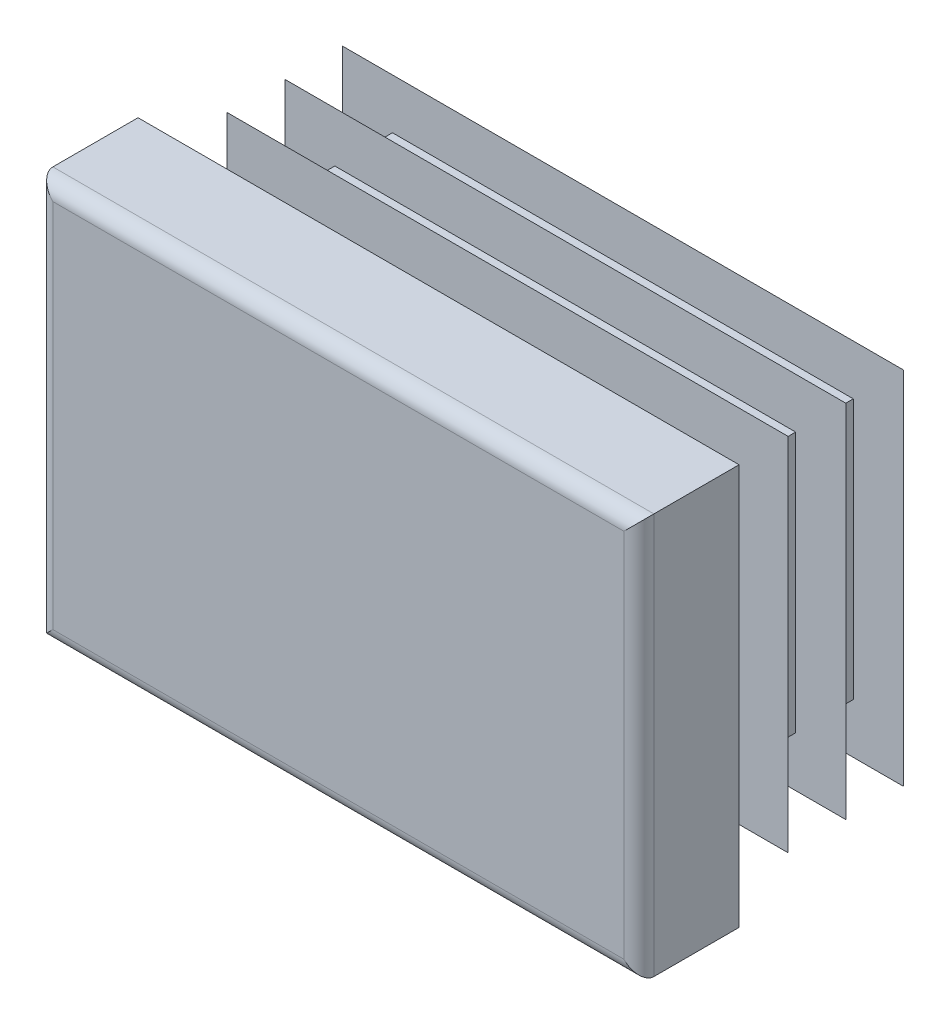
ISO-10303-21;
HEADER;
FILE_DESCRIPTION(('STEP AP214'),'2;1');
FILE_NAME('part.step','',(''),(''),'','','');
FILE_SCHEMA(('AUTOMOTIVE_DESIGN { 1 0 10303 214 1 1 1 1 }'));
ENDSEC;
DATA;
#1=APPLICATION_CONTEXT('core data for automotive mechanical design processes');
#2=APPLICATION_PROTOCOL_DEFINITION('international standard','automotive_design',2000,#1);
#3=PRODUCT_CONTEXT('',#1,'mechanical');
#4=PRODUCT('Part','Part','',(#3));
#5=PRODUCT_RELATED_PRODUCT_CATEGORY('part','',(#4));
#6=PRODUCT_DEFINITION_FORMATION('','',#4);
#7=PRODUCT_DEFINITION_CONTEXT('part definition',#1,'design');
#8=PRODUCT_DEFINITION('design','',#6,#7);
#9=PRODUCT_DEFINITION_SHAPE('','',#8);
#10=(LENGTH_UNIT() NAMED_UNIT(*) SI_UNIT(.MILLI.,.METRE.));
#11=(NAMED_UNIT(*) PLANE_ANGLE_UNIT() SI_UNIT($,.RADIAN.));
#12=(NAMED_UNIT(*) SI_UNIT($,.STERADIAN.) SOLID_ANGLE_UNIT());
#13=UNCERTAINTY_MEASURE_WITH_UNIT(LENGTH_MEASURE(1.E-05),#10,'distance_accuracy_value','');
#14=(GEOMETRIC_REPRESENTATION_CONTEXT(3) GLOBAL_UNCERTAINTY_ASSIGNED_CONTEXT((#13)) GLOBAL_UNIT_ASSIGNED_CONTEXT((#10,
#11,#12)) REPRESENTATION_CONTEXT('',''));
#15=CARTESIAN_POINT('',(0.,0.,0.));
#16=DIRECTION('',(0.,0.,1.));
#17=DIRECTION('',(1.,0.,0.));
#18=AXIS2_PLACEMENT_3D('',#15,#16,#17);
#19=CARTESIAN_POINT('',(14.25,-10.,5.));
#20=DIRECTION('',(0.,0.,-1.));
#21=DIRECTION('',(0.,1.,0.));
#22=AXIS2_PLACEMENT_3D('',#19,#20,#21);
#23=PLANE('',#22);
#24=DIRECTION('',(0.,1.,0.));
#25=VECTOR('',#24,1.);
#26=CARTESIAN_POINT('',(-14.25,-10.,5.));
#27=LINE('',#26,#25);
#28=CARTESIAN_POINT('',(-14.25,-9.25,5.));
#29=VERTEX_POINT('',#28);
#30=CARTESIAN_POINT('',(-14.25,9.25,5.));
#31=VERTEX_POINT('',#30);
#32=EDGE_CURVE('E310',#29,#31,#27,.T.);
#33=ORIENTED_EDGE('',*,*,#32,.F.);
#34=DIRECTION('',(-1.,0.,0.));
#35=VECTOR('',#34,1.);
#36=CARTESIAN_POINT('',(15.,-9.25,5.));
#37=LINE('',#36,#35);
#38=CARTESIAN_POINT('',(14.25,-9.25,5.));
#39=VERTEX_POINT('',#38);
#40=EDGE_CURVE('E482',#39,#29,#37,.T.);
#41=ORIENTED_EDGE('',*,*,#40,.F.);
#42=DIRECTION('',(0.,1.,0.));
#43=VECTOR('',#42,1.);
#44=CARTESIAN_POINT('',(14.25,-10.,5.));
#45=LINE('',#44,#43);
#46=CARTESIAN_POINT('',(14.25,9.25,5.));
#47=VERTEX_POINT('',#46);
#48=EDGE_CURVE('E305',#39,#47,#45,.T.);
#49=ORIENTED_EDGE('',*,*,#48,.T.);
#50=DIRECTION('',(-1.,0.,0.));
#51=VECTOR('',#50,1.);
#52=CARTESIAN_POINT('',(15.,9.25,5.));
#53=LINE('',#52,#51);
#54=EDGE_CURVE('E630',#47,#31,#53,.T.);
#55=ORIENTED_EDGE('',*,*,#54,.T.);
#56=EDGE_LOOP('',(#33,#41,#49,#55));
#57=FACE_BOUND('',#56,.T.);
#58=ADVANCED_FACE('F14',(#57),#23,.F.);
#59=CARTESIAN_POINT('',(-14.25,-10.,4.25));
#60=DIRECTION('',(0.,1.,0.));
#61=DIRECTION('',(-1.,0.,0.));
#62=AXIS2_PLACEMENT_3D('',#59,#60,#61);
#63=CYLINDRICAL_SURFACE('',#62,0.75);
#64=DIRECTION('',(0.,1.,0.));
#65=VECTOR('',#64,1.);
#66=CARTESIAN_POINT('',(-15.,-10.,4.25));
#67=LINE('',#66,#65);
#68=CARTESIAN_POINT('',(-15.,-10.,4.25));
#69=VERTEX_POINT('',#68);
#70=CARTESIAN_POINT('',(-15.,10.,4.25));
#71=VERTEX_POINT('',#70);
#72=EDGE_CURVE('E402',#69,#71,#67,.T.);
#73=ORIENTED_EDGE('',*,*,#72,.F.);
#74=CARTESIAN_POINT('',(-14.25,-9.25,4.25));
#75=DIRECTION('',(-0.707106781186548,0.707106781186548,0.));
#76=DIRECTION('',(0.707106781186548,0.707106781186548,0.));
#77=AXIS2_PLACEMENT_3D('',#74,#75,#76);
#78=ELLIPSE('',#77,1.06066017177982,0.75);
#79=EDGE_CURVE('E59',#69,#29,#78,.T.);
#80=ORIENTED_EDGE('',*,*,#79,.T.);
#81=ORIENTED_EDGE('',*,*,#32,.T.);
#82=CARTESIAN_POINT('',(-14.25,9.25,4.25));
#83=DIRECTION('',(0.707106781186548,0.707106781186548,0.));
#84=DIRECTION('',(-0.707106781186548,0.707106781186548,0.));
#85=AXIS2_PLACEMENT_3D('',#82,#83,#84);
#86=ELLIPSE('',#85,1.06066017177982,0.75);
#87=EDGE_CURVE('E306',#31,#71,#86,.F.);
#88=ORIENTED_EDGE('',*,*,#87,.T.);
#89=EDGE_LOOP('',(#73,#80,#81,#88));
#90=FACE_BOUND('',#89,.T.);
#91=ADVANCED_FACE('F16',(#90),#63,.T.);
#92=CARTESIAN_POINT('',(-15.,-10.,4.25));
#93=DIRECTION('',(1.,0.,0.));
#94=DIRECTION('',(0.,1.,0.));
#95=AXIS2_PLACEMENT_3D('',#92,#93,#94);
#96=PLANE('',#95);
#97=DIRECTION('',(0.,0.,-1.));
#98=VECTOR('',#97,1.);
#99=CARTESIAN_POINT('',(-15.,10.,4.25));
#100=LINE('',#99,#98);
#101=CARTESIAN_POINT('',(-15.,10.,0.));
#102=VERTEX_POINT('',#101);
#103=EDGE_CURVE('E615',#71,#102,#100,.T.);
#104=ORIENTED_EDGE('',*,*,#103,.T.);
#105=DIRECTION('',(0.,1.,0.));
#106=VECTOR('',#105,1.);
#107=CARTESIAN_POINT('',(-15.,-10.,0.));
#108=LINE('',#107,#106);
#109=CARTESIAN_POINT('',(-15.,-10.,0.));
#110=VERTEX_POINT('',#109);
#111=EDGE_CURVE('E400',#110,#102,#108,.T.);
#112=ORIENTED_EDGE('',*,*,#111,.F.);
#113=DIRECTION('',(0.,0.,-1.));
#114=VECTOR('',#113,1.);
#115=CARTESIAN_POINT('',(-15.,-10.,4.25));
#116=LINE('',#115,#114);
#117=EDGE_CURVE('E616',#69,#110,#116,.T.);
#118=ORIENTED_EDGE('',*,*,#117,.F.);
#119=ORIENTED_EDGE('',*,*,#72,.T.);
#120=EDGE_LOOP('',(#104,#112,#118,#119));
#121=FACE_BOUND('',#120,.T.);
#122=ADVANCED_FACE('F697',(#121),#96,.F.);
#123=CARTESIAN_POINT('',(-11.5,-10.,0.));
#124=DIRECTION('',(1.,0.,0.));
#125=DIRECTION('',(0.,1.,0.));
#126=AXIS2_PLACEMENT_3D('',#123,#124,#125);
#127=PLANE('',#126);
#128=DIRECTION('',(0.,1.,0.));
#129=VECTOR('',#128,1.);
#130=CARTESIAN_POINT('',(-11.5,-10.,0.));
#131=LINE('',#130,#129);
#132=CARTESIAN_POINT('',(-11.5,-6.5,0.));
#133=VERTEX_POINT('',#132);
#134=CARTESIAN_POINT('',(-11.5,6.5,0.));
#135=VERTEX_POINT('',#134);
#136=EDGE_CURVE('E397',#133,#135,#131,.T.);
#137=ORIENTED_EDGE('',*,*,#136,.T.);
#138=DIRECTION('',(0.,0.,-1.));
#139=VECTOR('',#138,1.);
#140=CARTESIAN_POINT('',(-11.5,6.5,0.));
#141=LINE('',#140,#139);
#142=CARTESIAN_POINT('',(-11.5,6.5,-0.575));
#143=VERTEX_POINT('',#142);
#144=EDGE_CURVE('E495',#135,#143,#141,.T.);
#145=ORIENTED_EDGE('',*,*,#144,.T.);
#146=DIRECTION('',(0.,1.,0.));
#147=VECTOR('',#146,1.);
#148=CARTESIAN_POINT('',(-11.5,-10.,-0.575));
#149=LINE('',#148,#147);
#150=CARTESIAN_POINT('',(-11.5,-6.5,-0.575));
#151=VERTEX_POINT('',#150);
#152=EDGE_CURVE('E394',#151,#143,#149,.T.);
#153=ORIENTED_EDGE('',*,*,#152,.F.);
#154=DIRECTION('',(0.,0.,1.));
#155=VECTOR('',#154,1.);
#156=CARTESIAN_POINT('',(-11.5,-6.5,0.));
#157=LINE('',#156,#155);
#158=EDGE_CURVE('E489',#151,#133,#157,.T.);
#159=ORIENTED_EDGE('',*,*,#158,.T.);
#160=EDGE_LOOP('',(#137,#145,#153,#159));
#161=FACE_BOUND('',#160,.T.);
#162=ADVANCED_FACE('F787',(#161),#127,.F.);
#163=CARTESIAN_POINT('',(-14.,-10.,-0.575));
#164=DIRECTION('',(0.342020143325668,0.,0.939692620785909));
#165=DIRECTION('',(-0.939692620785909,0.,0.342020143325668));
#166=AXIS2_PLACEMENT_3D('',#163,#164,#165);
#167=PLANE('',#166);
#168=DIRECTION('',(0.,1.,0.));
#169=VECTOR('',#168,1.);
#170=CARTESIAN_POINT('',(-14.,-10.,-0.575));
#171=LINE('',#170,#169);
#172=CARTESIAN_POINT('',(-14.,-9.,-0.575));
#173=VERTEX_POINT('',#172);
#174=CARTESIAN_POINT('',(-14.,9.,-0.575));
#175=VERTEX_POINT('',#174);
#176=EDGE_CURVE('E392',#173,#175,#171,.T.);
#177=ORIENTED_EDGE('',*,*,#176,.T.);
#178=DIRECTION('',(0.844349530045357,-0.438895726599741,-0.307318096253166));
#179=VECTOR('',#178,1.);
#180=CARTESIAN_POINT('',(-6.95895339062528,5.34004028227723,-3.13773138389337));
#181=LINE('',#180,#179);
#182=CARTESIAN_POINT('',(-11.5,7.70049158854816,-1.48492558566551));
#183=VERTEX_POINT('',#182);
#184=EDGE_CURVE('E519',#175,#183,#181,.T.);
#185=ORIENTED_EDGE('',*,*,#184,.T.);
#186=DIRECTION('',(0.,1.,0.));
#187=VECTOR('',#186,1.);
#188=CARTESIAN_POINT('',(-11.5,-10.,-1.48492558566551));
#189=LINE('',#188,#187);
#190=CARTESIAN_POINT('',(-11.5,-7.70049158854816,-1.48492558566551));
#191=VERTEX_POINT('',#190);
#192=EDGE_CURVE('E389',#191,#183,#189,.T.);
#193=ORIENTED_EDGE('',*,*,#192,.F.);
#194=DIRECTION('',(-0.844349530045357,-0.438895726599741,0.307318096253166));
#195=VECTOR('',#194,1.);
#196=CARTESIAN_POINT('',(-14.3705814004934,-9.19262945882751,-0.440119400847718));
#197=LINE('',#196,#195);
#198=EDGE_CURVE('E507',#191,#173,#197,.T.);
#199=ORIENTED_EDGE('',*,*,#198,.T.);
#200=EDGE_LOOP('',(#177,#185,#193,#199));
#201=FACE_BOUND('',#200,.T.);
#202=ADVANCED_FACE('F783',(#201),#167,.F.);
#203=CARTESIAN_POINT('',(-11.5,-10.,-1.48492558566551));
#204=DIRECTION('',(1.,0.,0.));
#205=DIRECTION('',(0.,1.,0.));
#206=AXIS2_PLACEMENT_3D('',#203,#204,#205);
#207=PLANE('',#206);
#208=ORIENTED_EDGE('',*,*,#192,.T.);
#209=DIRECTION('',(0.,-0.819152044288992,-0.573576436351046));
#210=VECTOR('',#209,1.);
#211=CARTESIAN_POINT('',(-11.5,-4.17671654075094,-9.80143625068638));
#212=LINE('',#211,#210);
#213=CARTESIAN_POINT('',(-11.5,6.5,-2.32551884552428));
#214=VERTEX_POINT('',#213);
#215=EDGE_CURVE('E516',#183,#214,#212,.T.);
#216=ORIENTED_EDGE('',*,*,#215,.T.);
#217=DIRECTION('',(0.,0.,-1.));
#218=VECTOR('',#217,1.);
#219=CARTESIAN_POINT('',(-11.5,6.5,-1.48492558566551));
#220=LINE('',#219,#218);
#221=CARTESIAN_POINT('',(-11.5,6.5,-3.45));
#222=VERTEX_POINT('',#221);
#223=EDGE_CURVE('E525',#214,#222,#220,.T.);
#224=ORIENTED_EDGE('',*,*,#223,.T.);
#225=DIRECTION('',(0.,1.,0.));
#226=VECTOR('',#225,1.);
#227=CARTESIAN_POINT('',(-11.5,-10.,-3.45));
#228=LINE('',#227,#226);
#229=CARTESIAN_POINT('',(-11.5,-6.5,-3.45));
#230=VERTEX_POINT('',#229);
#231=EDGE_CURVE('E386',#230,#222,#228,.T.);
#232=ORIENTED_EDGE('',*,*,#231,.F.);
#233=DIRECTION('',(0.,0.,1.));
#234=VECTOR('',#233,1.);
#235=CARTESIAN_POINT('',(-11.5,-6.5,-1.48492558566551));
#236=LINE('',#235,#234);
#237=CARTESIAN_POINT('',(-11.5,-6.5,-2.32551884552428));
#238=VERTEX_POINT('',#237);
#239=EDGE_CURVE('E522',#230,#238,#236,.T.);
#240=ORIENTED_EDGE('',*,*,#239,.T.);
#241=DIRECTION('',(0.,-0.819152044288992,0.573576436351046));
#242=VECTOR('',#241,1.);
#243=CARTESIAN_POINT('',(-11.5,-9.24348489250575,-0.404510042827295));
#244=LINE('',#243,#242);
#245=EDGE_CURVE('E504',#238,#191,#244,.T.);
#246=ORIENTED_EDGE('',*,*,#245,.T.);
#247=EDGE_LOOP('',(#208,#216,#224,#232,#240,#246));
#248=FACE_BOUND('',#247,.T.);
#249=ADVANCED_FACE('F779',(#248),#207,.F.);
#250=CARTESIAN_POINT('',(-14.,-10.,-3.45));
#251=DIRECTION('',(0.342020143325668,0.,0.939692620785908));
#252=DIRECTION('',(-0.939692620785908,0.,0.342020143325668));
#253=AXIS2_PLACEMENT_3D('',#250,#251,#252);
#254=PLANE('',#253);
#255=DIRECTION('',(0.,1.,0.));
#256=VECTOR('',#255,1.);
#257=CARTESIAN_POINT('',(-14.,-10.,-3.45));
#258=LINE('',#257,#256);
#259=CARTESIAN_POINT('',(-14.,-9.,-3.45));
#260=VERTEX_POINT('',#259);
#261=CARTESIAN_POINT('',(-14.,9.,-3.45));
#262=VERTEX_POINT('',#261);
#263=EDGE_CURVE('E384',#260,#262,#258,.T.);
#264=ORIENTED_EDGE('',*,*,#263,.T.);
#265=DIRECTION('',(0.844349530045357,-0.43889572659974,-0.307318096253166));
#266=VECTOR('',#265,1.);
#267=CARTESIAN_POINT('',(-6.95895339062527,5.34004028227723,-6.01273138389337));
#268=LINE('',#267,#266);
#269=CARTESIAN_POINT('',(-11.5,7.70049158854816,-4.35992558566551));
#270=VERTEX_POINT('',#269);
#271=EDGE_CURVE('E549',#262,#270,#268,.T.);
#272=ORIENTED_EDGE('',*,*,#271,.T.);
#273=DIRECTION('',(0.,1.,0.));
#274=VECTOR('',#273,1.);
#275=CARTESIAN_POINT('',(-11.5,-10.,-4.35992558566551));
#276=LINE('',#275,#274);
#277=CARTESIAN_POINT('',(-11.5,-7.70049158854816,-4.35992558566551));
#278=VERTEX_POINT('',#277);
#279=EDGE_CURVE('E381',#278,#270,#276,.T.);
#280=ORIENTED_EDGE('',*,*,#279,.F.);
#281=DIRECTION('',(-0.844349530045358,-0.438895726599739,0.307318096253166));
#282=VECTOR('',#281,1.);
#283=CARTESIAN_POINT('',(-14.3705814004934,-9.19262945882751,-3.31511940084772));
#284=LINE('',#283,#282);
#285=EDGE_CURVE('E537',#278,#260,#284,.T.);
#286=ORIENTED_EDGE('',*,*,#285,.T.);
#287=EDGE_LOOP('',(#264,#272,#280,#286));
#288=FACE_BOUND('',#287,.T.);
#289=ADVANCED_FACE('F775',(#288),#254,.F.);
#290=CARTESIAN_POINT('',(-11.5,-10.,-4.35992558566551));
#291=DIRECTION('',(1.,0.,0.));
#292=DIRECTION('',(0.,1.,0.));
#293=AXIS2_PLACEMENT_3D('',#290,#291,#292);
#294=PLANE('',#293);
#295=ORIENTED_EDGE('',*,*,#279,.T.);
#296=DIRECTION('',(0.,-0.819152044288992,-0.573576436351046));
#297=VECTOR('',#296,1.);
#298=CARTESIAN_POINT('',(-11.5,-4.17671654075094,-12.6764362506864));
#299=LINE('',#298,#297);
#300=CARTESIAN_POINT('',(-11.5,6.5,-5.20051884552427));
#301=VERTEX_POINT('',#300);
#302=EDGE_CURVE('E546',#270,#301,#299,.T.);
#303=ORIENTED_EDGE('',*,*,#302,.T.);
#304=DIRECTION('',(0.,0.,-1.));
#305=VECTOR('',#304,1.);
#306=CARTESIAN_POINT('',(-11.5,6.5,-4.35992558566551));
#307=LINE('',#306,#305);
#308=CARTESIAN_POINT('',(-11.5,6.5,-6.325));
#309=VERTEX_POINT('',#308);
#310=EDGE_CURVE('E555',#301,#309,#307,.T.);
#311=ORIENTED_EDGE('',*,*,#310,.T.);
#312=DIRECTION('',(0.,1.,0.));
#313=VECTOR('',#312,1.);
#314=CARTESIAN_POINT('',(-11.5,-10.,-6.325));
#315=LINE('',#314,#313);
#316=CARTESIAN_POINT('',(-11.5,-6.5,-6.325));
#317=VERTEX_POINT('',#316);
#318=EDGE_CURVE('E378',#317,#309,#315,.T.);
#319=ORIENTED_EDGE('',*,*,#318,.F.);
#320=DIRECTION('',(0.,0.,1.));
#321=VECTOR('',#320,1.);
#322=CARTESIAN_POINT('',(-11.5,-6.5,-4.35992558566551));
#323=LINE('',#322,#321);
#324=CARTESIAN_POINT('',(-11.5,-6.5,-5.20051884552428));
#325=VERTEX_POINT('',#324);
#326=EDGE_CURVE('E552',#317,#325,#323,.T.);
#327=ORIENTED_EDGE('',*,*,#326,.T.);
#328=DIRECTION('',(0.,-0.819152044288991,0.573576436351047));
#329=VECTOR('',#328,1.);
#330=CARTESIAN_POINT('',(-11.5,-9.24348489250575,-3.27951004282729));
#331=LINE('',#330,#329);
#332=EDGE_CURVE('E534',#325,#278,#331,.T.);
#333=ORIENTED_EDGE('',*,*,#332,.T.);
#334=EDGE_LOOP('',(#295,#303,#311,#319,#327,#333));
#335=FACE_BOUND('',#334,.T.);
#336=ADVANCED_FACE('F771',(#335),#294,.F.);
#337=CARTESIAN_POINT('',(-14.,-10.,-6.325));
#338=DIRECTION('',(0.34202014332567,0.,0.939692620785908));
#339=DIRECTION('',(-0.939692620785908,0.,0.34202014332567));
#340=AXIS2_PLACEMENT_3D('',#337,#338,#339);
#341=PLANE('',#340);
#342=DIRECTION('',(0.,1.,0.));
#343=VECTOR('',#342,1.);
#344=CARTESIAN_POINT('',(-14.,-10.,-6.325));
#345=LINE('',#344,#343);
#346=CARTESIAN_POINT('',(-14.,-9.,-6.325));
#347=VERTEX_POINT('',#346);
#348=CARTESIAN_POINT('',(-14.,9.,-6.325));
#349=VERTEX_POINT('',#348);
#350=EDGE_CURVE('E376',#347,#349,#345,.T.);
#351=ORIENTED_EDGE('',*,*,#350,.T.);
#352=DIRECTION('',(0.844349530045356,-0.438895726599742,-0.307318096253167));
#353=VECTOR('',#352,1.);
#354=CARTESIAN_POINT('',(-6.95895339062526,5.34004028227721,-8.88773138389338));
#355=LINE('',#354,#353);
#356=CARTESIAN_POINT('',(-11.5,7.70049158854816,-7.23492558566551));
#357=VERTEX_POINT('',#356);
#358=EDGE_CURVE('E579',#349,#357,#355,.T.);
#359=ORIENTED_EDGE('',*,*,#358,.T.);
#360=DIRECTION('',(0.,1.,0.));
#361=VECTOR('',#360,1.);
#362=CARTESIAN_POINT('',(-11.5,-10.,-7.23492558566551));
#363=LINE('',#362,#361);
#364=CARTESIAN_POINT('',(-11.5,-7.70049158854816,-7.23492558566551));
#365=VERTEX_POINT('',#364);
#366=EDGE_CURVE('E373',#365,#357,#363,.T.);
#367=ORIENTED_EDGE('',*,*,#366,.F.);
#368=DIRECTION('',(-0.844349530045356,-0.438895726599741,0.307318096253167));
#369=VECTOR('',#368,1.);
#370=CARTESIAN_POINT('',(-14.3705814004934,-9.19262945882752,-6.19011940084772));
#371=LINE('',#370,#369);
#372=EDGE_CURVE('E567',#365,#347,#371,.T.);
#373=ORIENTED_EDGE('',*,*,#372,.T.);
#374=EDGE_LOOP('',(#351,#359,#367,#373));
#375=FACE_BOUND('',#374,.T.);
#376=ADVANCED_FACE('F767',(#375),#341,.F.);
#377=CARTESIAN_POINT('',(-11.5,-10.,-7.23492558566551));
#378=DIRECTION('',(1.,0.,0.));
#379=DIRECTION('',(0.,1.,0.));
#380=AXIS2_PLACEMENT_3D('',#377,#378,#379);
#381=PLANE('',#380);
#382=ORIENTED_EDGE('',*,*,#366,.T.);
#383=DIRECTION('',(0.,-0.819152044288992,-0.573576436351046));
#384=VECTOR('',#383,1.);
#385=CARTESIAN_POINT('',(-11.5,-4.17671654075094,-15.5514362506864));
#386=LINE('',#385,#384);
#387=CARTESIAN_POINT('',(-11.5,6.5,-8.07551884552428));
#388=VERTEX_POINT('',#387);
#389=EDGE_CURVE('E576',#357,#388,#386,.T.);
#390=ORIENTED_EDGE('',*,*,#389,.T.);
#391=DIRECTION('',(0.,0.,-1.));
#392=VECTOR('',#391,1.);
#393=CARTESIAN_POINT('',(-11.5,6.5,-7.23492558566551));
#394=LINE('',#393,#392);
#395=CARTESIAN_POINT('',(-11.5,6.5,-9.2));
#396=VERTEX_POINT('',#395);
#397=EDGE_CURVE('E585',#388,#396,#394,.T.);
#398=ORIENTED_EDGE('',*,*,#397,.T.);
#399=DIRECTION('',(0.,1.,0.));
#400=VECTOR('',#399,1.);
#401=CARTESIAN_POINT('',(-11.5,-10.,-9.2));
#402=LINE('',#401,#400);
#403=CARTESIAN_POINT('',(-11.5,-6.5,-9.2));
#404=VERTEX_POINT('',#403);
#405=EDGE_CURVE('E370',#404,#396,#402,.T.);
#406=ORIENTED_EDGE('',*,*,#405,.F.);
#407=DIRECTION('',(0.,0.,1.));
#408=VECTOR('',#407,1.);
#409=CARTESIAN_POINT('',(-11.5,-6.5,-7.23492558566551));
#410=LINE('',#409,#408);
#411=CARTESIAN_POINT('',(-11.5,-6.5,-8.07551884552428));
#412=VERTEX_POINT('',#411);
#413=EDGE_CURVE('E582',#404,#412,#410,.T.);
#414=ORIENTED_EDGE('',*,*,#413,.T.);
#415=DIRECTION('',(0.,-0.819152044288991,0.573576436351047));
#416=VECTOR('',#415,1.);
#417=CARTESIAN_POINT('',(-11.5,-9.24348489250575,-6.1545100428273));
#418=LINE('',#417,#416);
#419=EDGE_CURVE('E564',#412,#365,#418,.T.);
#420=ORIENTED_EDGE('',*,*,#419,.T.);
#421=EDGE_LOOP('',(#382,#390,#398,#406,#414,#420));
#422=FACE_BOUND('',#421,.T.);
#423=ADVANCED_FACE('F764',(#422),#381,.F.);
#424=CARTESIAN_POINT('',(-14.,-10.,-9.2));
#425=DIRECTION('',(0.342020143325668,0.,0.939692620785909));
#426=DIRECTION('',(-0.939692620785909,0.,0.342020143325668));
#427=AXIS2_PLACEMENT_3D('',#424,#425,#426);
#428=PLANE('',#427);
#429=DIRECTION('',(0.,1.,0.));
#430=VECTOR('',#429,1.);
#431=CARTESIAN_POINT('',(-14.,-10.,-9.2));
#432=LINE('',#431,#430);
#433=CARTESIAN_POINT('',(-14.,-9.,-9.2));
#434=VERTEX_POINT('',#433);
#435=CARTESIAN_POINT('',(-14.,9.,-9.2));
#436=VERTEX_POINT('',#435);
#437=EDGE_CURVE('E368',#434,#436,#432,.T.);
#438=ORIENTED_EDGE('',*,*,#437,.T.);
#439=DIRECTION('',(0.844349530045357,-0.43889572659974,-0.307318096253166));
#440=VECTOR('',#439,1.);
#441=CARTESIAN_POINT('',(-6.95895339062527,5.34004028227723,-11.7627313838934));
#442=LINE('',#441,#440);
#443=CARTESIAN_POINT('',(-11.5,7.70049158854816,-10.1099255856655));
#444=VERTEX_POINT('',#443);
#445=EDGE_CURVE('E607',#436,#444,#442,.T.);
#446=ORIENTED_EDGE('',*,*,#445,.T.);
#447=DIRECTION('',(0.,1.,0.));
#448=VECTOR('',#447,1.);
#449=CARTESIAN_POINT('',(-11.5,-10.,-10.1099255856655));
#450=LINE('',#449,#448);
#451=CARTESIAN_POINT('',(-11.5,-7.70049158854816,-10.1099255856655));
#452=VERTEX_POINT('',#451);
#453=EDGE_CURVE('E365',#452,#444,#450,.T.);
#454=ORIENTED_EDGE('',*,*,#453,.F.);
#455=DIRECTION('',(-0.844349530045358,-0.43889572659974,0.307318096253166));
#456=VECTOR('',#455,1.);
#457=CARTESIAN_POINT('',(-14.3705814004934,-9.19262945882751,-9.06511940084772));
#458=LINE('',#457,#456);
#459=EDGE_CURVE('E595',#452,#434,#458,.T.);
#460=ORIENTED_EDGE('',*,*,#459,.T.);
#461=EDGE_LOOP('',(#438,#446,#454,#460));
#462=FACE_BOUND('',#461,.T.);
#463=ADVANCED_FACE('F675',(#462),#428,.F.);
#464=CARTESIAN_POINT('',(-11.5,-10.,-10.1099255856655));
#465=DIRECTION('',(1.,0.,0.));
#466=DIRECTION('',(0.,1.,0.));
#467=AXIS2_PLACEMENT_3D('',#464,#465,#466);
#468=PLANE('',#467);
#469=ORIENTED_EDGE('',*,*,#453,.T.);
#470=DIRECTION('',(0.,-0.819152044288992,-0.573576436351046));
#471=VECTOR('',#470,1.);
#472=CARTESIAN_POINT('',(-11.5,-4.17671654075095,-18.4264362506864));
#473=LINE('',#472,#471);
#474=CARTESIAN_POINT('',(-11.5,6.5,-10.9505188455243));
#475=VERTEX_POINT('',#474);
#476=EDGE_CURVE('E604',#444,#475,#473,.T.);
#477=ORIENTED_EDGE('',*,*,#476,.T.);
#478=DIRECTION('',(0.,0.,-1.));
#479=VECTOR('',#478,1.);
#480=CARTESIAN_POINT('',(-11.5,6.5,-10.1099255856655));
#481=LINE('',#480,#479);
#482=CARTESIAN_POINT('',(-11.5,6.5,-11.5));
#483=VERTEX_POINT('',#482);
#484=EDGE_CURVE('E613',#475,#483,#481,.T.);
#485=ORIENTED_EDGE('',*,*,#484,.T.);
#486=DIRECTION('',(0.,1.,0.));
#487=VECTOR('',#486,1.);
#488=CARTESIAN_POINT('',(-11.5,-10.,-11.5));
#489=LINE('',#488,#487);
#490=CARTESIAN_POINT('',(-11.5,-6.5,-11.5));
#491=VERTEX_POINT('',#490);
#492=EDGE_CURVE('E362',#491,#483,#489,.T.);
#493=ORIENTED_EDGE('',*,*,#492,.F.);
#494=DIRECTION('',(0.,0.,1.));
#495=VECTOR('',#494,1.);
#496=CARTESIAN_POINT('',(-11.5,-6.5,-10.1099255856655));
#497=LINE('',#496,#495);
#498=CARTESIAN_POINT('',(-11.5,-6.5,-10.9505188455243));
#499=VERTEX_POINT('',#498);
#500=EDGE_CURVE('E610',#491,#499,#497,.T.);
#501=ORIENTED_EDGE('',*,*,#500,.T.);
#502=DIRECTION('',(0.,-0.819152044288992,0.573576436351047));
#503=VECTOR('',#502,1.);
#504=CARTESIAN_POINT('',(-11.5,-9.24348489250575,-9.02951004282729));
#505=LINE('',#504,#503);
#506=EDGE_CURVE('E592',#499,#452,#505,.T.);
#507=ORIENTED_EDGE('',*,*,#506,.T.);
#508=EDGE_LOOP('',(#469,#477,#485,#493,#501,#507));
#509=FACE_BOUND('',#508,.T.);
#510=ADVANCED_FACE('F677',(#509),#468,.F.);
#511=CARTESIAN_POINT('',(-11.5,-10.,-11.5));
#512=DIRECTION('',(0.,0.,1.));
#513=DIRECTION('',(0.,-1.,0.));
#514=AXIS2_PLACEMENT_3D('',#511,#512,#513);
#515=PLANE('',#514);
#516=ORIENTED_EDGE('',*,*,#492,.T.);
#517=DIRECTION('',(-1.,0.,0.));
#518=VECTOR('',#517,1.);
#519=CARTESIAN_POINT('',(15.,6.5,-11.5));
#520=LINE('',#519,#518);
#521=CARTESIAN_POINT('',(11.5,6.5,-11.5));
#522=VERTEX_POINT('',#521);
#523=EDGE_CURVE('E438',#522,#483,#520,.T.);
#524=ORIENTED_EDGE('',*,*,#523,.F.);
#525=DIRECTION('',(0.,1.,0.));
#526=VECTOR('',#525,1.);
#527=CARTESIAN_POINT('',(11.5,-10.,-11.5));
#528=LINE('',#527,#526);
#529=CARTESIAN_POINT('',(11.5,-6.5,-11.5));
#530=VERTEX_POINT('',#529);
#531=EDGE_CURVE('E359',#530,#522,#528,.T.);
#532=ORIENTED_EDGE('',*,*,#531,.F.);
#533=DIRECTION('',(-1.,0.,0.));
#534=VECTOR('',#533,1.);
#535=CARTESIAN_POINT('',(15.,-6.5,-11.5));
#536=LINE('',#535,#534);
#537=EDGE_CURVE('E436',#530,#491,#536,.T.);
#538=ORIENTED_EDGE('',*,*,#537,.T.);
#539=EDGE_LOOP('',(#516,#524,#532,#538));
#540=FACE_BOUND('',#539,.T.);
#541=ADVANCED_FACE('F435',(#540),#515,.F.);
#542=CARTESIAN_POINT('',(11.5,-10.,-11.5));
#543=DIRECTION('',(-1.,0.,0.));
#544=DIRECTION('',(0.,-1.,0.));
#545=AXIS2_PLACEMENT_3D('',#542,#543,#544);
#546=PLANE('',#545);
#547=DIRECTION('',(0.,0.,1.));
#548=VECTOR('',#547,1.);
#549=CARTESIAN_POINT('',(11.5,6.5,-11.5));
#550=LINE('',#549,#548);
#551=CARTESIAN_POINT('',(11.5,6.5,-10.9505188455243));
#552=VERTEX_POINT('',#551);
#553=EDGE_CURVE('E9',#522,#552,#550,.T.);
#554=ORIENTED_EDGE('',*,*,#553,.T.);
#555=DIRECTION('',(0.,0.819152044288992,0.573576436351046));
#556=VECTOR('',#555,1.);
#557=CARTESIAN_POINT('',(11.5,-4.82983787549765,-18.8837567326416));
#558=LINE('',#557,#556);
#559=CARTESIAN_POINT('',(11.5,7.70049158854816,-10.1099255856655));
#560=VERTEX_POINT('',#559);
#561=EDGE_CURVE('E601',#552,#560,#558,.T.);
#562=ORIENTED_EDGE('',*,*,#561,.T.);
#563=DIRECTION('',(0.,1.,0.));
#564=VECTOR('',#563,1.);
#565=CARTESIAN_POINT('',(11.5,-10.,-10.1099255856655));
#566=LINE('',#565,#564);
#567=CARTESIAN_POINT('',(11.5,-7.70049158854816,-10.1099255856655));
#568=VERTEX_POINT('',#567);
#569=EDGE_CURVE('E356',#568,#560,#566,.T.);
#570=ORIENTED_EDGE('',*,*,#569,.F.);
#571=DIRECTION('',(0.,0.819152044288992,-0.573576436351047));
#572=VECTOR('',#571,1.);
#573=CARTESIAN_POINT('',(11.5,-8.59036355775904,-9.48683052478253));
#574=LINE('',#573,#572);
#575=CARTESIAN_POINT('',(11.5,-6.5,-10.9505188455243));
#576=VERTEX_POINT('',#575);
#577=EDGE_CURVE('E428',#568,#576,#574,.T.);
#578=ORIENTED_EDGE('',*,*,#577,.T.);
#579=DIRECTION('',(0.,0.,-1.));
#580=VECTOR('',#579,1.);
#581=CARTESIAN_POINT('',(11.5,-6.5,-11.5));
#582=LINE('',#581,#580);
#583=EDGE_CURVE('E23',#576,#530,#582,.T.);
#584=ORIENTED_EDGE('',*,*,#583,.T.);
#585=ORIENTED_EDGE('',*,*,#531,.T.);
#586=EDGE_LOOP('',(#554,#562,#570,#578,#584,#585));
#587=FACE_BOUND('',#586,.T.);
#588=ADVANCED_FACE('F426',(#587),#546,.F.);
#589=CARTESIAN_POINT('',(11.5,-10.,-10.1099255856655));
#590=DIRECTION('',(-0.342020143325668,0.,0.939692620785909));
#591=DIRECTION('',(-0.939692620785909,0.,-0.342020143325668));
#592=AXIS2_PLACEMENT_3D('',#589,#590,#591);
#593=PLANE('',#592);
#594=ORIENTED_EDGE('',*,*,#569,.T.);
#595=DIRECTION('',(0.844349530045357,0.43889572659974,0.307318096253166));
#596=VECTOR('',#595,1.);
#597=CARTESIAN_POINT('',(4.94052703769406,4.29085547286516,-12.4973784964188));
#598=LINE('',#597,#596);
#599=CARTESIAN_POINT('',(14.,9.,-9.2));
#600=VERTEX_POINT('',#599);
#601=EDGE_CURVE('E598',#560,#600,#598,.T.);
#602=ORIENTED_EDGE('',*,*,#601,.T.);
#603=DIRECTION('',(0.,1.,0.));
#604=VECTOR('',#603,1.);
#605=CARTESIAN_POINT('',(14.,-10.,-9.2));
#606=LINE('',#605,#604);
#607=CARTESIAN_POINT('',(14.,-9.,-9.2));
#608=VERTEX_POINT('',#607);
#609=EDGE_CURVE('E353',#608,#600,#606,.T.);
#610=ORIENTED_EDGE('',*,*,#609,.F.);
#611=DIRECTION('',(-0.844349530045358,0.43889572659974,-0.307318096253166));
#612=VECTOR('',#611,1.);
#613=CARTESIAN_POINT('',(12.3521550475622,-8.14344464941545,-9.79976651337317));
#614=LINE('',#613,#612);
#615=EDGE_CURVE('E588',#608,#568,#614,.T.);
#616=ORIENTED_EDGE('',*,*,#615,.T.);
#617=EDGE_LOOP('',(#594,#602,#610,#616));
#618=FACE_BOUND('',#617,.T.);
#619=ADVANCED_FACE('F752',(#618),#593,.F.);
#620=CARTESIAN_POINT('',(14.,-10.,-9.2));
#621=DIRECTION('',(0.,0.,-1.));
#622=DIRECTION('',(0.,1.,0.));
#623=AXIS2_PLACEMENT_3D('',#620,#621,#622);
#624=PLANE('',#623);
#625=ORIENTED_EDGE('',*,*,#609,.T.);
#626=DIRECTION('',(-1.,0.,0.));
#627=VECTOR('',#626,1.);
#628=CARTESIAN_POINT('',(15.,9.,-9.2));
#629=LINE('',#628,#627);
#630=EDGE_CURVE('E444',#600,#436,#629,.T.);
#631=ORIENTED_EDGE('',*,*,#630,.T.);
#632=ORIENTED_EDGE('',*,*,#437,.F.);
#633=DIRECTION('',(-1.,0.,0.));
#634=VECTOR('',#633,1.);
#635=CARTESIAN_POINT('',(15.,-9.,-9.2));
#636=LINE('',#635,#634);
#637=EDGE_CURVE('E451',#608,#434,#636,.T.);
#638=ORIENTED_EDGE('',*,*,#637,.F.);
#639=EDGE_LOOP('',(#625,#631,#632,#638));
#640=FACE_BOUND('',#639,.T.);
#641=ORIENTED_EDGE('',*,*,#405,.T.);
#642=DIRECTION('',(-1.,0.,0.));
#643=VECTOR('',#642,1.);
#644=CARTESIAN_POINT('',(15.,6.5,-9.2));
#645=LINE('',#644,#643);
#646=CARTESIAN_POINT('',(11.5,6.5,-9.2));
#647=VERTEX_POINT('',#646);
#648=EDGE_CURVE('E663',#647,#396,#645,.T.);
#649=ORIENTED_EDGE('',*,*,#648,.F.);
#650=DIRECTION('',(0.,1.,0.));
#651=VECTOR('',#650,1.);
#652=CARTESIAN_POINT('',(11.5,-10.,-9.2));
#653=LINE('',#652,#651);
#654=CARTESIAN_POINT('',(11.5,-6.5,-9.2));
#655=VERTEX_POINT('',#654);
#656=EDGE_CURVE('E350',#655,#647,#653,.T.);
#657=ORIENTED_EDGE('',*,*,#656,.F.);
#658=DIRECTION('',(-1.,0.,0.));
#659=VECTOR('',#658,1.);
#660=CARTESIAN_POINT('',(15.,-6.5,-9.2));
#661=LINE('',#660,#659);
#662=EDGE_CURVE('E453',#655,#404,#661,.T.);
#663=ORIENTED_EDGE('',*,*,#662,.T.);
#664=EDGE_LOOP('',(#641,#649,#657,#663));
#665=FACE_BOUND('',#664,.T.);
#666=ADVANCED_FACE('F667',(#640,#665),#624,.F.);
#667=CARTESIAN_POINT('',(11.5,-10.,-9.2));
#668=DIRECTION('',(-1.,0.,0.));
#669=DIRECTION('',(0.,-1.,0.));
#670=AXIS2_PLACEMENT_3D('',#667,#668,#669);
#671=PLANE('',#670);
#672=DIRECTION('',(0.,0.,1.));
#673=VECTOR('',#672,1.);
#674=CARTESIAN_POINT('',(11.5,6.5,-9.2));
#675=LINE('',#674,#673);
#676=CARTESIAN_POINT('',(11.5,6.5,-8.07551884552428));
#677=VERTEX_POINT('',#676);
#678=EDGE_CURVE('E420',#647,#677,#675,.T.);
#679=ORIENTED_EDGE('',*,*,#678,.T.);
#680=DIRECTION('',(0.,0.819152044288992,0.573576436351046));
#681=VECTOR('',#680,1.);
#682=CARTESIAN_POINT('',(11.5,-5.0999995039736,-16.1979259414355));
#683=LINE('',#682,#681);
#684=CARTESIAN_POINT('',(11.5,7.70049158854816,-7.23492558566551));
#685=VERTEX_POINT('',#684);
#686=EDGE_CURVE('E573',#677,#685,#683,.T.);
#687=ORIENTED_EDGE('',*,*,#686,.T.);
#688=DIRECTION('',(0.,1.,0.));
#689=VECTOR('',#688,1.);
#690=CARTESIAN_POINT('',(11.5,-10.,-7.23492558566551));
#691=LINE('',#690,#689);
#692=CARTESIAN_POINT('',(11.5,-7.70049158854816,-7.23492558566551));
#693=VERTEX_POINT('',#692);
#694=EDGE_CURVE('E347',#693,#685,#691,.T.);
#695=ORIENTED_EDGE('',*,*,#694,.F.);
#696=DIRECTION('',(0.,0.819152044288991,-0.573576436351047));
#697=VECTOR('',#696,1.);
#698=CARTESIAN_POINT('',(11.5,-8.32020192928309,-6.8009997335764));
#699=LINE('',#698,#697);
#700=CARTESIAN_POINT('',(11.5,-6.5,-8.07551884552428));
#701=VERTEX_POINT('',#700);
#702=EDGE_CURVE('E561',#693,#701,#699,.T.);
#703=ORIENTED_EDGE('',*,*,#702,.T.);
#704=DIRECTION('',(0.,0.,-1.));
#705=VECTOR('',#704,1.);
#706=CARTESIAN_POINT('',(11.5,-6.5,-9.2));
#707=LINE('',#706,#705);
#708=EDGE_CURVE('E417',#701,#655,#707,.T.);
#709=ORIENTED_EDGE('',*,*,#708,.T.);
#710=ORIENTED_EDGE('',*,*,#656,.T.);
#711=EDGE_LOOP('',(#679,#687,#695,#703,#709,#710));
#712=FACE_BOUND('',#711,.T.);
#713=ADVANCED_FACE('F745',(#712),#671,.F.);
#714=CARTESIAN_POINT('',(11.5,-10.,-7.23492558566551));
#715=DIRECTION('',(-0.342020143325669,0.,0.939692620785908));
#716=DIRECTION('',(-0.939692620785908,0.,-0.342020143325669));
#717=AXIS2_PLACEMENT_3D('',#714,#715,#716);
#718=PLANE('',#717);
#719=ORIENTED_EDGE('',*,*,#694,.T.);
#720=DIRECTION('',(0.844349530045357,0.438895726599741,0.307318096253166));
#721=VECTOR('',#720,1.);
#722=CARTESIAN_POINT('',(4.94052703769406,4.29085547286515,-9.62237849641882));
#723=LINE('',#722,#721);
#724=CARTESIAN_POINT('',(14.,9.,-6.325));
#725=VERTEX_POINT('',#724);
#726=EDGE_CURVE('E570',#685,#725,#723,.T.);
#727=ORIENTED_EDGE('',*,*,#726,.T.);
#728=DIRECTION('',(0.,1.,0.));
#729=VECTOR('',#728,1.);
#730=CARTESIAN_POINT('',(14.,-10.,-6.325));
#731=LINE('',#730,#729);
#732=CARTESIAN_POINT('',(14.,-9.,-6.325));
#733=VERTEX_POINT('',#732);
#734=EDGE_CURVE('E344',#733,#725,#731,.T.);
#735=ORIENTED_EDGE('',*,*,#734,.F.);
#736=DIRECTION('',(-0.844349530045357,0.43889572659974,-0.307318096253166));
#737=VECTOR('',#736,1.);
#738=CARTESIAN_POINT('',(12.3521550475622,-8.14344464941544,-6.92476651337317));
#739=LINE('',#738,#737);
#740=EDGE_CURVE('E558',#733,#693,#739,.T.);
#741=ORIENTED_EDGE('',*,*,#740,.T.);
#742=EDGE_LOOP('',(#719,#727,#735,#741));
#743=FACE_BOUND('',#742,.T.);
#744=ADVANCED_FACE('F741',(#743),#718,.F.);
#745=CARTESIAN_POINT('',(14.,-10.,-6.325));
#746=DIRECTION('',(0.,0.,-1.));
#747=DIRECTION('',(0.,1.,0.));
#748=AXIS2_PLACEMENT_3D('',#745,#746,#747);
#749=PLANE('',#748);
#750=ORIENTED_EDGE('',*,*,#734,.T.);
#751=DIRECTION('',(-1.,0.,0.));
#752=VECTOR('',#751,1.);
#753=CARTESIAN_POINT('',(15.,9.,-6.325));
#754=LINE('',#753,#752);
#755=EDGE_CURVE('E657',#725,#349,#754,.T.);
#756=ORIENTED_EDGE('',*,*,#755,.T.);
#757=ORIENTED_EDGE('',*,*,#350,.F.);
#758=DIRECTION('',(-1.,0.,0.));
#759=VECTOR('',#758,1.);
#760=CARTESIAN_POINT('',(15.,-9.,-6.325));
#761=LINE('',#760,#759);
#762=EDGE_CURVE('E459',#733,#347,#761,.T.);
#763=ORIENTED_EDGE('',*,*,#762,.F.);
#764=EDGE_LOOP('',(#750,#756,#757,#763));
#765=FACE_BOUND('',#764,.T.);
#766=ORIENTED_EDGE('',*,*,#318,.T.);
#767=DIRECTION('',(-1.,0.,0.));
#768=VECTOR('',#767,1.);
#769=CARTESIAN_POINT('',(15.,6.5,-6.325));
#770=LINE('',#769,#768);
#771=CARTESIAN_POINT('',(11.5,6.5,-6.325));
#772=VERTEX_POINT('',#771);
#773=EDGE_CURVE('E655',#772,#309,#770,.T.);
#774=ORIENTED_EDGE('',*,*,#773,.F.);
#775=DIRECTION('',(0.,1.,0.));
#776=VECTOR('',#775,1.);
#777=CARTESIAN_POINT('',(11.5,-10.,-6.325));
#778=LINE('',#777,#776);
#779=CARTESIAN_POINT('',(11.5,-6.5,-6.325));
#780=VERTEX_POINT('',#779);
#781=EDGE_CURVE('E341',#780,#772,#778,.T.);
#782=ORIENTED_EDGE('',*,*,#781,.F.);
#783=DIRECTION('',(-1.,0.,0.));
#784=VECTOR('',#783,1.);
#785=CARTESIAN_POINT('',(15.,-6.5,-6.325));
#786=LINE('',#785,#784);
#787=EDGE_CURVE('E461',#780,#317,#786,.T.);
#788=ORIENTED_EDGE('',*,*,#787,.T.);
#789=EDGE_LOOP('',(#766,#774,#782,#788));
#790=FACE_BOUND('',#789,.T.);
#791=ADVANCED_FACE('F737',(#765,#790),#749,.F.);
#792=CARTESIAN_POINT('',(11.5,-10.,-6.325));
#793=DIRECTION('',(-1.,0.,0.));
#794=DIRECTION('',(0.,-1.,0.));
#795=AXIS2_PLACEMENT_3D('',#792,#793,#794);
#796=PLANE('',#795);
#797=DIRECTION('',(0.,0.,1.));
#798=VECTOR('',#797,1.);
#799=CARTESIAN_POINT('',(11.5,6.5,-6.325));
#800=LINE('',#799,#798);
#801=CARTESIAN_POINT('',(11.5,6.5,-5.20051884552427));
#802=VERTEX_POINT('',#801);
#803=EDGE_CURVE('E414',#772,#802,#800,.T.);
#804=ORIENTED_EDGE('',*,*,#803,.T.);
#805=DIRECTION('',(0.,0.819152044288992,0.573576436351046));
#806=VECTOR('',#805,1.);
#807=CARTESIAN_POINT('',(11.5,-5.0999995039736,-13.3229259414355));
#808=LINE('',#807,#806);
#809=CARTESIAN_POINT('',(11.5,7.70049158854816,-4.35992558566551));
#810=VERTEX_POINT('',#809);
#811=EDGE_CURVE('E543',#802,#810,#808,.T.);
#812=ORIENTED_EDGE('',*,*,#811,.T.);
#813=DIRECTION('',(0.,1.,0.));
#814=VECTOR('',#813,1.);
#815=CARTESIAN_POINT('',(11.5,-10.,-4.35992558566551));
#816=LINE('',#815,#814);
#817=CARTESIAN_POINT('',(11.5,-7.70049158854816,-4.35992558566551));
#818=VERTEX_POINT('',#817);
#819=EDGE_CURVE('E338',#818,#810,#816,.T.);
#820=ORIENTED_EDGE('',*,*,#819,.F.);
#821=DIRECTION('',(0.,0.819152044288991,-0.573576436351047));
#822=VECTOR('',#821,1.);
#823=CARTESIAN_POINT('',(11.5,-8.32020192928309,-3.9259997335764));
#824=LINE('',#823,#822);
#825=CARTESIAN_POINT('',(11.5,-6.5,-5.20051884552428));
#826=VERTEX_POINT('',#825);
#827=EDGE_CURVE('E531',#818,#826,#824,.T.);
#828=ORIENTED_EDGE('',*,*,#827,.T.);
#829=DIRECTION('',(0.,0.,-1.));
#830=VECTOR('',#829,1.);
#831=CARTESIAN_POINT('',(11.5,-6.5,-6.325));
#832=LINE('',#831,#830);
#833=EDGE_CURVE('E411',#826,#780,#832,.T.);
#834=ORIENTED_EDGE('',*,*,#833,.T.);
#835=ORIENTED_EDGE('',*,*,#781,.T.);
#836=EDGE_LOOP('',(#804,#812,#820,#828,#834,#835));
#837=FACE_BOUND('',#836,.T.);
#838=ADVANCED_FACE('F733',(#837),#796,.F.);
#839=CARTESIAN_POINT('',(11.5,-10.,-4.35992558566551));
#840=DIRECTION('',(-0.342020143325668,0.,0.939692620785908));
#841=DIRECTION('',(-0.939692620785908,0.,-0.342020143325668));
#842=AXIS2_PLACEMENT_3D('',#839,#840,#841);
#843=PLANE('',#842);
#844=ORIENTED_EDGE('',*,*,#819,.T.);
#845=DIRECTION('',(0.844349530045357,0.43889572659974,0.307318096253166));
#846=VECTOR('',#845,1.);
#847=CARTESIAN_POINT('',(4.94052703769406,4.29085547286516,-6.74737849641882));
#848=LINE('',#847,#846);
#849=CARTESIAN_POINT('',(14.,9.,-3.45));
#850=VERTEX_POINT('',#849);
#851=EDGE_CURVE('E540',#810,#850,#848,.T.);
#852=ORIENTED_EDGE('',*,*,#851,.T.);
#853=DIRECTION('',(0.,1.,0.));
#854=VECTOR('',#853,1.);
#855=CARTESIAN_POINT('',(14.,-10.,-3.45));
#856=LINE('',#855,#854);
#857=CARTESIAN_POINT('',(14.,-9.,-3.45));
#858=VERTEX_POINT('',#857);
#859=EDGE_CURVE('E335',#858,#850,#856,.T.);
#860=ORIENTED_EDGE('',*,*,#859,.F.);
#861=DIRECTION('',(-0.844349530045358,0.438895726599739,-0.307318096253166));
#862=VECTOR('',#861,1.);
#863=CARTESIAN_POINT('',(12.3521550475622,-8.14344464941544,-4.04976651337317));
#864=LINE('',#863,#862);
#865=EDGE_CURVE('E528',#858,#818,#864,.T.);
#866=ORIENTED_EDGE('',*,*,#865,.T.);
#867=EDGE_LOOP('',(#844,#852,#860,#866));
#868=FACE_BOUND('',#867,.T.);
#869=ADVANCED_FACE('F729',(#868),#843,.F.);
#870=CARTESIAN_POINT('',(14.,-10.,-3.45));
#871=DIRECTION('',(0.,0.,-1.));
#872=DIRECTION('',(0.,1.,0.));
#873=AXIS2_PLACEMENT_3D('',#870,#871,#872);
#874=PLANE('',#873);
#875=ORIENTED_EDGE('',*,*,#859,.T.);
#876=DIRECTION('',(-1.,0.,0.));
#877=VECTOR('',#876,1.);
#878=CARTESIAN_POINT('',(15.,9.,-3.45));
#879=LINE('',#878,#877);
#880=EDGE_CURVE('E649',#850,#262,#879,.T.);
#881=ORIENTED_EDGE('',*,*,#880,.T.);
#882=ORIENTED_EDGE('',*,*,#263,.F.);
#883=DIRECTION('',(-1.,0.,0.));
#884=VECTOR('',#883,1.);
#885=CARTESIAN_POINT('',(15.,-9.,-3.45));
#886=LINE('',#885,#884);
#887=EDGE_CURVE('E467',#858,#260,#886,.T.);
#888=ORIENTED_EDGE('',*,*,#887,.F.);
#889=EDGE_LOOP('',(#875,#881,#882,#888));
#890=FACE_BOUND('',#889,.T.);
#891=ORIENTED_EDGE('',*,*,#231,.T.);
#892=DIRECTION('',(-1.,0.,0.));
#893=VECTOR('',#892,1.);
#894=CARTESIAN_POINT('',(15.,6.5,-3.45));
#895=LINE('',#894,#893);
#896=CARTESIAN_POINT('',(11.5,6.5,-3.45));
#897=VERTEX_POINT('',#896);
#898=EDGE_CURVE('E647',#897,#222,#895,.T.);
#899=ORIENTED_EDGE('',*,*,#898,.F.);
#900=DIRECTION('',(0.,1.,0.));
#901=VECTOR('',#900,1.);
#902=CARTESIAN_POINT('',(11.5,-10.,-3.45));
#903=LINE('',#902,#901);
#904=CARTESIAN_POINT('',(11.5,-6.5,-3.45));
#905=VERTEX_POINT('',#904);
#906=EDGE_CURVE('E332',#905,#897,#903,.T.);
#907=ORIENTED_EDGE('',*,*,#906,.F.);
#908=DIRECTION('',(-1.,0.,0.));
#909=VECTOR('',#908,1.);
#910=CARTESIAN_POINT('',(15.,-6.5,-3.45));
#911=LINE('',#910,#909);
#912=EDGE_CURVE('E469',#905,#230,#911,.T.);
#913=ORIENTED_EDGE('',*,*,#912,.T.);
#914=EDGE_LOOP('',(#891,#899,#907,#913));
#915=FACE_BOUND('',#914,.T.);
#916=ADVANCED_FACE('F725',(#890,#915),#874,.F.);
#917=CARTESIAN_POINT('',(11.5,-10.,-3.45));
#918=DIRECTION('',(-1.,0.,0.));
#919=DIRECTION('',(0.,-1.,0.));
#920=AXIS2_PLACEMENT_3D('',#917,#918,#919);
#921=PLANE('',#920);
#922=DIRECTION('',(0.,0.,1.));
#923=VECTOR('',#922,1.);
#924=CARTESIAN_POINT('',(11.5,6.5,-3.45));
#925=LINE('',#924,#923);
#926=CARTESIAN_POINT('',(11.5,6.5,-2.32551884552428));
#927=VERTEX_POINT('',#926);
#928=EDGE_CURVE('E408',#897,#927,#925,.T.);
#929=ORIENTED_EDGE('',*,*,#928,.T.);
#930=DIRECTION('',(0.,0.819152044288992,0.573576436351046));
#931=VECTOR('',#930,1.);
#932=CARTESIAN_POINT('',(11.5,-5.0999995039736,-10.4479259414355));
#933=LINE('',#932,#931);
#934=CARTESIAN_POINT('',(11.5,7.70049158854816,-1.4849255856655));
#935=VERTEX_POINT('',#934);
#936=EDGE_CURVE('E513',#927,#935,#933,.T.);
#937=ORIENTED_EDGE('',*,*,#936,.T.);
#938=DIRECTION('',(0.,1.,0.));
#939=VECTOR('',#938,1.);
#940=CARTESIAN_POINT('',(11.5,-10.,-1.48492558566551));
#941=LINE('',#940,#939);
#942=CARTESIAN_POINT('',(11.5,-7.70049158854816,-1.48492558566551));
#943=VERTEX_POINT('',#942);
#944=EDGE_CURVE('E329',#943,#935,#941,.T.);
#945=ORIENTED_EDGE('',*,*,#944,.F.);
#946=DIRECTION('',(0.,0.819152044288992,-0.573576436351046));
#947=VECTOR('',#946,1.);
#948=CARTESIAN_POINT('',(11.5,-8.32020192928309,-1.0509997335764));
#949=LINE('',#948,#947);
#950=CARTESIAN_POINT('',(11.5,-6.5,-2.32551884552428));
#951=VERTEX_POINT('',#950);
#952=EDGE_CURVE('E501',#943,#951,#949,.T.);
#953=ORIENTED_EDGE('',*,*,#952,.T.);
#954=DIRECTION('',(0.,0.,-1.));
#955=VECTOR('',#954,1.);
#956=CARTESIAN_POINT('',(11.5,-6.5,-3.45));
#957=LINE('',#956,#955);
#958=EDGE_CURVE('E405',#951,#905,#957,.T.);
#959=ORIENTED_EDGE('',*,*,#958,.T.);
#960=ORIENTED_EDGE('',*,*,#906,.T.);
#961=EDGE_LOOP('',(#929,#937,#945,#953,#959,#960));
#962=FACE_BOUND('',#961,.T.);
#963=ADVANCED_FACE('F721',(#962),#921,.F.);
#964=CARTESIAN_POINT('',(11.5,-10.,-1.48492558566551));
#965=DIRECTION('',(-0.342020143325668,0.,0.939692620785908));
#966=DIRECTION('',(-0.939692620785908,0.,-0.342020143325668));
#967=AXIS2_PLACEMENT_3D('',#964,#965,#966);
#968=PLANE('',#967);
#969=ORIENTED_EDGE('',*,*,#944,.T.);
#970=DIRECTION('',(0.844349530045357,0.438895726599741,0.307318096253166));
#971=VECTOR('',#970,1.);
#972=CARTESIAN_POINT('',(4.94052703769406,4.29085547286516,-3.87237849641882));
#973=LINE('',#972,#971);
#974=CARTESIAN_POINT('',(14.,9.,-0.575));
#975=VERTEX_POINT('',#974);
#976=EDGE_CURVE('E510',#935,#975,#973,.T.);
#977=ORIENTED_EDGE('',*,*,#976,.T.);
#978=DIRECTION('',(0.,1.,0.));
#979=VECTOR('',#978,1.);
#980=CARTESIAN_POINT('',(14.,-10.,-0.575));
#981=LINE('',#980,#979);
#982=CARTESIAN_POINT('',(14.,-9.,-0.575));
#983=VERTEX_POINT('',#982);
#984=EDGE_CURVE('E326',#983,#975,#981,.T.);
#985=ORIENTED_EDGE('',*,*,#984,.F.);
#986=DIRECTION('',(-0.844349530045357,0.438895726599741,-0.307318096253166));
#987=VECTOR('',#986,1.);
#988=CARTESIAN_POINT('',(12.3521550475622,-8.14344464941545,-1.17476651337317));
#989=LINE('',#988,#987);
#990=EDGE_CURVE('E498',#983,#943,#989,.T.);
#991=ORIENTED_EDGE('',*,*,#990,.T.);
#992=EDGE_LOOP('',(#969,#977,#985,#991));
#993=FACE_BOUND('',#992,.T.);
#994=ADVANCED_FACE('F717',(#993),#968,.F.);
#995=CARTESIAN_POINT('',(14.,-10.,-0.575));
#996=DIRECTION('',(0.,0.,-1.));
#997=DIRECTION('',(0.,1.,0.));
#998=AXIS2_PLACEMENT_3D('',#995,#996,#997);
#999=PLANE('',#998);
#1000=ORIENTED_EDGE('',*,*,#984,.T.);
#1001=DIRECTION('',(-1.,0.,0.));
#1002=VECTOR('',#1001,1.);
#1003=CARTESIAN_POINT('',(15.,9.,-0.575));
#1004=LINE('',#1003,#1002);
#1005=EDGE_CURVE('E641',#975,#175,#1004,.T.);
#1006=ORIENTED_EDGE('',*,*,#1005,.T.);
#1007=ORIENTED_EDGE('',*,*,#176,.F.);
#1008=DIRECTION('',(-1.,0.,0.));
#1009=VECTOR('',#1008,1.);
#1010=CARTESIAN_POINT('',(15.,-9.,-0.575));
#1011=LINE('',#1010,#1009);
#1012=EDGE_CURVE('E475',#983,#173,#1011,.T.);
#1013=ORIENTED_EDGE('',*,*,#1012,.F.);
#1014=EDGE_LOOP('',(#1000,#1006,#1007,#1013));
#1015=FACE_BOUND('',#1014,.T.);
#1016=ORIENTED_EDGE('',*,*,#152,.T.);
#1017=DIRECTION('',(-1.,0.,0.));
#1018=VECTOR('',#1017,1.);
#1019=CARTESIAN_POINT('',(15.,6.5,-0.575));
#1020=LINE('',#1019,#1018);
#1021=CARTESIAN_POINT('',(11.5,6.5,-0.575));
#1022=VERTEX_POINT('',#1021);
#1023=EDGE_CURVE('E639',#1022,#143,#1020,.T.);
#1024=ORIENTED_EDGE('',*,*,#1023,.F.);
#1025=DIRECTION('',(0.,1.,0.));
#1026=VECTOR('',#1025,1.);
#1027=CARTESIAN_POINT('',(11.5,-10.,-0.575));
#1028=LINE('',#1027,#1026);
#1029=CARTESIAN_POINT('',(11.5,-6.5,-0.575));
#1030=VERTEX_POINT('',#1029);
#1031=EDGE_CURVE('E323',#1030,#1022,#1028,.T.);
#1032=ORIENTED_EDGE('',*,*,#1031,.F.);
#1033=DIRECTION('',(-1.,0.,0.));
#1034=VECTOR('',#1033,1.);
#1035=CARTESIAN_POINT('',(15.,-6.5,-0.575));
#1036=LINE('',#1035,#1034);
#1037=EDGE_CURVE('E477',#1030,#151,#1036,.T.);
#1038=ORIENTED_EDGE('',*,*,#1037,.T.);
#1039=EDGE_LOOP('',(#1016,#1024,#1032,#1038));
#1040=FACE_BOUND('',#1039,.T.);
#1041=ADVANCED_FACE('F713',(#1015,#1040),#999,.F.);
#1042=CARTESIAN_POINT('',(11.5,-10.,-0.575));
#1043=DIRECTION('',(-1.,0.,0.));
#1044=DIRECTION('',(0.,-1.,0.));
#1045=AXIS2_PLACEMENT_3D('',#1042,#1043,#1044);
#1046=PLANE('',#1045);
#1047=ORIENTED_EDGE('',*,*,#1031,.T.);
#1048=DIRECTION('',(0.,0.,1.));
#1049=VECTOR('',#1048,1.);
#1050=CARTESIAN_POINT('',(11.5,6.5,-0.575));
#1051=LINE('',#1050,#1049);
#1052=CARTESIAN_POINT('',(11.5,6.5,0.));
#1053=VERTEX_POINT('',#1052);
#1054=EDGE_CURVE('E492',#1022,#1053,#1051,.T.);
#1055=ORIENTED_EDGE('',*,*,#1054,.T.);
#1056=DIRECTION('',(0.,1.,0.));
#1057=VECTOR('',#1056,1.);
#1058=CARTESIAN_POINT('',(11.5,-10.,0.));
#1059=LINE('',#1058,#1057);
#1060=CARTESIAN_POINT('',(11.5,-6.5,0.));
#1061=VERTEX_POINT('',#1060);
#1062=EDGE_CURVE('E316',#1061,#1053,#1059,.T.);
#1063=ORIENTED_EDGE('',*,*,#1062,.F.);
#1064=DIRECTION('',(0.,0.,-1.));
#1065=VECTOR('',#1064,1.);
#1066=CARTESIAN_POINT('',(11.5,-6.5,-0.575));
#1067=LINE('',#1066,#1065);
#1068=EDGE_CURVE('E486',#1061,#1030,#1067,.T.);
#1069=ORIENTED_EDGE('',*,*,#1068,.T.);
#1070=EDGE_LOOP('',(#1047,#1055,#1063,#1069));
#1071=FACE_BOUND('',#1070,.T.);
#1072=ADVANCED_FACE('F709',(#1071),#1046,.F.);
#1073=CARTESIAN_POINT('',(11.5,-10.,0.));
#1074=DIRECTION('',(0.,0.,1.));
#1075=DIRECTION('',(0.,-1.,0.));
#1076=AXIS2_PLACEMENT_3D('',#1073,#1074,#1075);
#1077=PLANE('',#1076);
#1078=DIRECTION('',(-1.,0.,0.));
#1079=VECTOR('',#1078,1.);
#1080=CARTESIAN_POINT('',(15.,6.5,0.));
#1081=LINE('',#1080,#1079);
#1082=EDGE_CURVE('E634',#1053,#135,#1081,.T.);
#1083=ORIENTED_EDGE('',*,*,#1082,.T.);
#1084=ORIENTED_EDGE('',*,*,#136,.F.);
#1085=DIRECTION('',(-1.,0.,0.));
#1086=VECTOR('',#1085,1.);
#1087=CARTESIAN_POINT('',(15.,-6.5,0.));
#1088=LINE('',#1087,#1086);
#1089=EDGE_CURVE('E296',#1061,#133,#1088,.T.);
#1090=ORIENTED_EDGE('',*,*,#1089,.F.);
#1091=ORIENTED_EDGE('',*,*,#1062,.T.);
#1092=EDGE_LOOP('',(#1083,#1084,#1090,#1091));
#1093=FACE_BOUND('',#1092,.T.);
#1094=ORIENTED_EDGE('',*,*,#111,.T.);
#1095=DIRECTION('',(1.,0.,0.));
#1096=VECTOR('',#1095,1.);
#1097=CARTESIAN_POINT('',(11.5,10.,0.));
#1098=LINE('',#1097,#1096);
#1099=CARTESIAN_POINT('',(15.,10.,0.));
#1100=VERTEX_POINT('',#1099);
#1101=EDGE_CURVE('E621',#102,#1100,#1098,.T.);
#1102=ORIENTED_EDGE('',*,*,#1101,.T.);
#1103=DIRECTION('',(0.,1.,0.));
#1104=VECTOR('',#1103,1.);
#1105=CARTESIAN_POINT('',(15.,-10.,0.));
#1106=LINE('',#1105,#1104);
#1107=CARTESIAN_POINT('',(15.,-10.,0.));
#1108=VERTEX_POINT('',#1107);
#1109=EDGE_CURVE('E45',#1108,#1100,#1106,.T.);
#1110=ORIENTED_EDGE('',*,*,#1109,.F.);
#1111=DIRECTION('',(1.,0.,0.));
#1112=VECTOR('',#1111,1.);
#1113=CARTESIAN_POINT('',(-15.,-10.,0.));
#1114=LINE('',#1113,#1112);
#1115=EDGE_CURVE('E31',#110,#1108,#1114,.T.);
#1116=ORIENTED_EDGE('',*,*,#1115,.F.);
#1117=EDGE_LOOP('',(#1094,#1102,#1110,#1116));
#1118=FACE_BOUND('',#1117,.T.);
#1119=ADVANCED_FACE('F706',(#1093,#1118),#1077,.F.);
#1120=CARTESIAN_POINT('',(15.,-10.,0.));
#1121=DIRECTION('',(-1.,0.,0.));
#1122=DIRECTION('',(0.,-1.,0.));
#1123=AXIS2_PLACEMENT_3D('',#1120,#1121,#1122);
#1124=PLANE('',#1123);
#1125=DIRECTION('',(0.,0.,1.));
#1126=VECTOR('',#1125,1.);
#1127=CARTESIAN_POINT('',(15.,10.,0.));
#1128=LINE('',#1127,#1126);
#1129=CARTESIAN_POINT('',(15.,10.,4.25));
#1130=VERTEX_POINT('',#1129);
#1131=EDGE_CURVE('E314',#1100,#1130,#1128,.T.);
#1132=ORIENTED_EDGE('',*,*,#1131,.T.);
#1133=DIRECTION('',(0.,1.,0.));
#1134=VECTOR('',#1133,1.);
#1135=CARTESIAN_POINT('',(15.,-10.,4.25));
#1136=LINE('',#1135,#1134);
#1137=CARTESIAN_POINT('',(15.,-10.,4.25));
#1138=VERTEX_POINT('',#1137);
#1139=EDGE_CURVE('E303',#1138,#1130,#1136,.T.);
#1140=ORIENTED_EDGE('',*,*,#1139,.F.);
#1141=DIRECTION('',(0.,0.,1.));
#1142=VECTOR('',#1141,1.);
#1143=CARTESIAN_POINT('',(15.,-10.,0.));
#1144=LINE('',#1143,#1142);
#1145=EDGE_CURVE('E308',#1108,#1138,#1144,.T.);
#1146=ORIENTED_EDGE('',*,*,#1145,.F.);
#1147=ORIENTED_EDGE('',*,*,#1109,.T.);
#1148=EDGE_LOOP('',(#1132,#1140,#1146,#1147));
#1149=FACE_BOUND('',#1148,.T.);
#1150=ADVANCED_FACE('F312',(#1149),#1124,.F.);
#1151=CARTESIAN_POINT('',(14.25,-10.,4.25));
#1152=DIRECTION('',(0.,1.,0.));
#1153=DIRECTION('',(-1.,0.,0.));
#1154=AXIS2_PLACEMENT_3D('',#1151,#1152,#1153);
#1155=CYLINDRICAL_SURFACE('',#1154,0.75);
#1156=ORIENTED_EDGE('',*,*,#48,.F.);
#1157=CARTESIAN_POINT('',(14.25,-9.25,4.25));
#1158=DIRECTION('',(0.707106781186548,0.707106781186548,0.));
#1159=DIRECTION('',(-0.707106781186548,0.707106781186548,0.));
#1160=AXIS2_PLACEMENT_3D('',#1157,#1158,#1159);
#1161=ELLIPSE('',#1160,1.06066017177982,0.75);
#1162=EDGE_CURVE('E293',#39,#1138,#1161,.T.);
#1163=ORIENTED_EDGE('',*,*,#1162,.T.);
#1164=ORIENTED_EDGE('',*,*,#1139,.T.);
#1165=CARTESIAN_POINT('',(14.25,9.25,4.25));
#1166=DIRECTION('',(-0.707106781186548,0.707106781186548,0.));
#1167=DIRECTION('',(0.707106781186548,0.707106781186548,0.));
#1168=AXIS2_PLACEMENT_3D('',#1165,#1166,#1167);
#1169=ELLIPSE('',#1168,1.06066017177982,0.75);
#1170=EDGE_CURVE('E52',#1130,#47,#1169,.F.);
#1171=ORIENTED_EDGE('',*,*,#1170,.T.);
#1172=EDGE_LOOP('',(#1156,#1163,#1164,#1171));
#1173=FACE_BOUND('',#1172,.T.);
#1174=ADVANCED_FACE('F301',(#1173),#1155,.T.);
#1175=CARTESIAN_POINT('',(-14.25,-10.,4.25));
#1176=DIRECTION('',(0.,-1.,0.));
#1177=DIRECTION('',(1.,0.,0.));
#1178=AXIS2_PLACEMENT_3D('',#1175,#1176,#1177);
#1179=PLANE('',#1178);
#1180=DIRECTION('',(-1.,0.,0.));
#1181=VECTOR('',#1180,1.);
#1182=CARTESIAN_POINT('',(15.,-10.,4.25));
#1183=LINE('',#1182,#1181);
#1184=EDGE_CURVE('E290',#1138,#69,#1183,.T.);
#1185=ORIENTED_EDGE('',*,*,#1184,.T.);
#1186=ORIENTED_EDGE('',*,*,#117,.T.);
#1187=ORIENTED_EDGE('',*,*,#1115,.T.);
#1188=ORIENTED_EDGE('',*,*,#1145,.T.);
#1189=EDGE_LOOP('',(#1185,#1186,#1187,#1188));
#1190=FACE_BOUND('',#1189,.T.);
#1191=ADVANCED_FACE('F309',(#1190),#1179,.T.);
#1192=CARTESIAN_POINT('',(-14.25,10.,4.25));
#1193=DIRECTION('',(0.,-1.,0.));
#1194=DIRECTION('',(1.,0.,0.));
#1195=AXIS2_PLACEMENT_3D('',#1192,#1193,#1194);
#1196=PLANE('',#1195);
#1197=ORIENTED_EDGE('',*,*,#103,.F.);
#1198=DIRECTION('',(-1.,0.,0.));
#1199=VECTOR('',#1198,1.);
#1200=CARTESIAN_POINT('',(15.,10.,4.25));
#1201=LINE('',#1200,#1199);
#1202=EDGE_CURVE('E631',#1130,#71,#1201,.T.);
#1203=ORIENTED_EDGE('',*,*,#1202,.F.);
#1204=ORIENTED_EDGE('',*,*,#1131,.F.);
#1205=ORIENTED_EDGE('',*,*,#1101,.F.);
#1206=EDGE_LOOP('',(#1197,#1203,#1204,#1205));
#1207=FACE_BOUND('',#1206,.T.);
#1208=ADVANCED_FACE('F700',(#1207),#1196,.F.);
#1209=CARTESIAN_POINT('',(15.,6.5,-0.575));
#1210=DIRECTION('',(0.,-1.,0.));
#1211=DIRECTION('',(1.,0.,0.));
#1212=AXIS2_PLACEMENT_3D('',#1209,#1210,#1211);
#1213=PLANE('',#1212);
#1214=ORIENTED_EDGE('',*,*,#1082,.F.);
#1215=ORIENTED_EDGE('',*,*,#1054,.F.);
#1216=ORIENTED_EDGE('',*,*,#1023,.T.);
#1217=ORIENTED_EDGE('',*,*,#144,.F.);
#1218=EDGE_LOOP('',(#1214,#1215,#1216,#1217));
#1219=FACE_BOUND('',#1218,.T.);
#1220=ADVANCED_FACE('F812',(#1219),#1213,.F.);
#1221=CARTESIAN_POINT('',(15.,6.5,-2.32551884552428));
#1222=DIRECTION('',(0.,-0.573576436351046,0.819152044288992));
#1223=DIRECTION('',(0.,-0.819152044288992,-0.573576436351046));
#1224=AXIS2_PLACEMENT_3D('',#1221,#1222,#1223);
#1225=PLANE('',#1224);
#1226=ORIENTED_EDGE('',*,*,#1005,.F.);
#1227=ORIENTED_EDGE('',*,*,#976,.F.);
#1228=ORIENTED_EDGE('',*,*,#936,.F.);
#1229=DIRECTION('',(-1.,0.,0.));
#1230=VECTOR('',#1229,1.);
#1231=CARTESIAN_POINT('',(15.,6.5,-2.32551884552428));
#1232=LINE('',#1231,#1230);
#1233=EDGE_CURVE('E644',#927,#214,#1232,.T.);
#1234=ORIENTED_EDGE('',*,*,#1233,.T.);
#1235=ORIENTED_EDGE('',*,*,#215,.F.);
#1236=ORIENTED_EDGE('',*,*,#184,.F.);
#1237=EDGE_LOOP('',(#1226,#1227,#1228,#1234,#1235,#1236));
#1238=FACE_BOUND('',#1237,.T.);
#1239=ADVANCED_FACE('F815',(#1238),#1225,.F.);
#1240=CARTESIAN_POINT('',(15.,6.5,-3.45));
#1241=DIRECTION('',(0.,-1.,0.));
#1242=DIRECTION('',(1.,0.,0.));
#1243=AXIS2_PLACEMENT_3D('',#1240,#1241,#1242);
#1244=PLANE('',#1243);
#1245=ORIENTED_EDGE('',*,*,#1233,.F.);
#1246=ORIENTED_EDGE('',*,*,#928,.F.);
#1247=ORIENTED_EDGE('',*,*,#898,.T.);
#1248=ORIENTED_EDGE('',*,*,#223,.F.);
#1249=EDGE_LOOP('',(#1245,#1246,#1247,#1248));
#1250=FACE_BOUND('',#1249,.T.);
#1251=ADVANCED_FACE('F819',(#1250),#1244,.F.);
#1252=CARTESIAN_POINT('',(15.,6.5,-5.20051884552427));
#1253=DIRECTION('',(0.,-0.573576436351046,0.819152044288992));
#1254=DIRECTION('',(0.,-0.819152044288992,-0.573576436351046));
#1255=AXIS2_PLACEMENT_3D('',#1252,#1253,#1254);
#1256=PLANE('',#1255);
#1257=ORIENTED_EDGE('',*,*,#880,.F.);
#1258=ORIENTED_EDGE('',*,*,#851,.F.);
#1259=ORIENTED_EDGE('',*,*,#811,.F.);
#1260=DIRECTION('',(-1.,0.,0.));
#1261=VECTOR('',#1260,1.);
#1262=CARTESIAN_POINT('',(15.,6.5,-5.20051884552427));
#1263=LINE('',#1262,#1261);
#1264=EDGE_CURVE('E652',#802,#301,#1263,.T.);
#1265=ORIENTED_EDGE('',*,*,#1264,.T.);
#1266=ORIENTED_EDGE('',*,*,#302,.F.);
#1267=ORIENTED_EDGE('',*,*,#271,.F.);
#1268=EDGE_LOOP('',(#1257,#1258,#1259,#1265,#1266,#1267));
#1269=FACE_BOUND('',#1268,.T.);
#1270=ADVANCED_FACE('F823',(#1269),#1256,.F.);
#1271=CARTESIAN_POINT('',(15.,6.5,-6.325));
#1272=DIRECTION('',(0.,-1.,0.));
#1273=DIRECTION('',(1.,0.,0.));
#1274=AXIS2_PLACEMENT_3D('',#1271,#1272,#1273);
#1275=PLANE('',#1274);
#1276=ORIENTED_EDGE('',*,*,#1264,.F.);
#1277=ORIENTED_EDGE('',*,*,#803,.F.);
#1278=ORIENTED_EDGE('',*,*,#773,.T.);
#1279=ORIENTED_EDGE('',*,*,#310,.F.);
#1280=EDGE_LOOP('',(#1276,#1277,#1278,#1279));
#1281=FACE_BOUND('',#1280,.T.);
#1282=ADVANCED_FACE('F827',(#1281),#1275,.F.);
#1283=CARTESIAN_POINT('',(15.,6.5,-8.07551884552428));
#1284=DIRECTION('',(0.,-0.573576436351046,0.819152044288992));
#1285=DIRECTION('',(0.,-0.819152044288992,-0.573576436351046));
#1286=AXIS2_PLACEMENT_3D('',#1283,#1284,#1285);
#1287=PLANE('',#1286);
#1288=ORIENTED_EDGE('',*,*,#755,.F.);
#1289=ORIENTED_EDGE('',*,*,#726,.F.);
#1290=ORIENTED_EDGE('',*,*,#686,.F.);
#1291=DIRECTION('',(-1.,0.,0.));
#1292=VECTOR('',#1291,1.);
#1293=CARTESIAN_POINT('',(15.,6.5,-8.07551884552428));
#1294=LINE('',#1293,#1292);
#1295=EDGE_CURVE('E660',#677,#388,#1294,.T.);
#1296=ORIENTED_EDGE('',*,*,#1295,.T.);
#1297=ORIENTED_EDGE('',*,*,#389,.F.);
#1298=ORIENTED_EDGE('',*,*,#358,.F.);
#1299=EDGE_LOOP('',(#1288,#1289,#1290,#1296,#1297,#1298));
#1300=FACE_BOUND('',#1299,.T.);
#1301=ADVANCED_FACE('F831',(#1300),#1287,.F.);
#1302=CARTESIAN_POINT('',(15.,6.5,-9.2));
#1303=DIRECTION('',(0.,-1.,0.));
#1304=DIRECTION('',(1.,0.,0.));
#1305=AXIS2_PLACEMENT_3D('',#1302,#1303,#1304);
#1306=PLANE('',#1305);
#1307=ORIENTED_EDGE('',*,*,#1295,.F.);
#1308=ORIENTED_EDGE('',*,*,#678,.F.);
#1309=ORIENTED_EDGE('',*,*,#648,.T.);
#1310=ORIENTED_EDGE('',*,*,#397,.F.);
#1311=EDGE_LOOP('',(#1307,#1308,#1309,#1310));
#1312=FACE_BOUND('',#1311,.T.);
#1313=ADVANCED_FACE('F835',(#1312),#1306,.F.);
#1314=CARTESIAN_POINT('',(15.,6.5,-10.9505188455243));
#1315=DIRECTION('',(0.,-0.573576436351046,0.819152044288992));
#1316=DIRECTION('',(0.,-0.819152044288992,-0.573576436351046));
#1317=AXIS2_PLACEMENT_3D('',#1314,#1315,#1316);
#1318=PLANE('',#1317);
#1319=ORIENTED_EDGE('',*,*,#630,.F.);
#1320=ORIENTED_EDGE('',*,*,#601,.F.);
#1321=ORIENTED_EDGE('',*,*,#561,.F.);
#1322=DIRECTION('',(-1.,0.,0.));
#1323=VECTOR('',#1322,1.);
#1324=CARTESIAN_POINT('',(15.,6.5,-10.9505188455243));
#1325=LINE('',#1324,#1323);
#1326=EDGE_CURVE('E441',#552,#475,#1325,.T.);
#1327=ORIENTED_EDGE('',*,*,#1326,.T.);
#1328=ORIENTED_EDGE('',*,*,#476,.F.);
#1329=ORIENTED_EDGE('',*,*,#445,.F.);
#1330=EDGE_LOOP('',(#1319,#1320,#1321,#1327,#1328,#1329));
#1331=FACE_BOUND('',#1330,.T.);
#1332=ADVANCED_FACE('F672',(#1331),#1318,.F.);
#1333=CARTESIAN_POINT('',(15.,6.5,-11.5));
#1334=DIRECTION('',(0.,-1.,0.));
#1335=DIRECTION('',(1.,0.,0.));
#1336=AXIS2_PLACEMENT_3D('',#1333,#1334,#1335);
#1337=PLANE('',#1336);
#1338=ORIENTED_EDGE('',*,*,#1326,.F.);
#1339=ORIENTED_EDGE('',*,*,#553,.F.);
#1340=ORIENTED_EDGE('',*,*,#523,.T.);
#1341=ORIENTED_EDGE('',*,*,#484,.F.);
#1342=EDGE_LOOP('',(#1338,#1339,#1340,#1341));
#1343=FACE_BOUND('',#1342,.T.);
#1344=ADVANCED_FACE('F802',(#1343),#1337,.F.);
#1345=CARTESIAN_POINT('',(15.,9.25,4.25));
#1346=DIRECTION('',(-1.,0.,0.));
#1347=DIRECTION('',(0.,-1.,0.));
#1348=AXIS2_PLACEMENT_3D('',#1345,#1346,#1347);
#1349=CYLINDRICAL_SURFACE('',#1348,0.75);
#1350=ORIENTED_EDGE('',*,*,#54,.F.);
#1351=ORIENTED_EDGE('',*,*,#1170,.F.);
#1352=ORIENTED_EDGE('',*,*,#1202,.T.);
#1353=ORIENTED_EDGE('',*,*,#87,.F.);
#1354=EDGE_LOOP('',(#1350,#1351,#1352,#1353));
#1355=FACE_BOUND('',#1354,.T.);
#1356=ADVANCED_FACE('F799',(#1355),#1349,.T.);
#1357=CARTESIAN_POINT('',(15.,-6.5,0.));
#1358=DIRECTION('',(0.,1.,0.));
#1359=DIRECTION('',(-1.,0.,0.));
#1360=AXIS2_PLACEMENT_3D('',#1357,#1358,#1359);
#1361=PLANE('',#1360);
#1362=ORIENTED_EDGE('',*,*,#1037,.F.);
#1363=ORIENTED_EDGE('',*,*,#1068,.F.);
#1364=ORIENTED_EDGE('',*,*,#1089,.T.);
#1365=ORIENTED_EDGE('',*,*,#158,.F.);
#1366=EDGE_LOOP('',(#1362,#1363,#1364,#1365));
#1367=FACE_BOUND('',#1366,.T.);
#1368=ADVANCED_FACE('F801',(#1367),#1361,.F.);
#1369=CARTESIAN_POINT('',(15.,-9.,-0.575));
#1370=DIRECTION('',(0.,0.573576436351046,0.819152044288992));
#1371=DIRECTION('',(0.,-0.819152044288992,0.573576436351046));
#1372=AXIS2_PLACEMENT_3D('',#1369,#1370,#1371);
#1373=PLANE('',#1372);
#1374=ORIENTED_EDGE('',*,*,#245,.F.);
#1375=DIRECTION('',(-1.,0.,0.));
#1376=VECTOR('',#1375,1.);
#1377=CARTESIAN_POINT('',(15.,-6.5,-2.32551884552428));
#1378=LINE('',#1377,#1376);
#1379=EDGE_CURVE('E472',#951,#238,#1378,.T.);
#1380=ORIENTED_EDGE('',*,*,#1379,.F.);
#1381=ORIENTED_EDGE('',*,*,#952,.F.);
#1382=ORIENTED_EDGE('',*,*,#990,.F.);
#1383=ORIENTED_EDGE('',*,*,#1012,.T.);
#1384=ORIENTED_EDGE('',*,*,#198,.F.);
#1385=EDGE_LOOP('',(#1374,#1380,#1381,#1382,#1383,#1384));
#1386=FACE_BOUND('',#1385,.T.);
#1387=ADVANCED_FACE('F808',(#1386),#1373,.F.);
#1388=CARTESIAN_POINT('',(15.,-6.5,-2.32551884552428));
#1389=DIRECTION('',(0.,1.,0.));
#1390=DIRECTION('',(-1.,0.,0.));
#1391=AXIS2_PLACEMENT_3D('',#1388,#1389,#1390);
#1392=PLANE('',#1391);
#1393=ORIENTED_EDGE('',*,*,#912,.F.);
#1394=ORIENTED_EDGE('',*,*,#958,.F.);
#1395=ORIENTED_EDGE('',*,*,#1379,.T.);
#1396=ORIENTED_EDGE('',*,*,#239,.F.);
#1397=EDGE_LOOP('',(#1393,#1394,#1395,#1396));
#1398=FACE_BOUND('',#1397,.T.);
#1399=ADVANCED_FACE('F873',(#1398),#1392,.F.);
#1400=CARTESIAN_POINT('',(15.,-9.,-3.45));
#1401=DIRECTION('',(0.,0.573576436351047,0.819152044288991));
#1402=DIRECTION('',(0.,-0.819152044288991,0.573576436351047));
#1403=AXIS2_PLACEMENT_3D('',#1400,#1401,#1402);
#1404=PLANE('',#1403);
#1405=ORIENTED_EDGE('',*,*,#332,.F.);
#1406=DIRECTION('',(-1.,0.,0.));
#1407=VECTOR('',#1406,1.);
#1408=CARTESIAN_POINT('',(15.,-6.5,-5.20051884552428));
#1409=LINE('',#1408,#1407);
#1410=EDGE_CURVE('E464',#826,#325,#1409,.T.);
#1411=ORIENTED_EDGE('',*,*,#1410,.F.);
#1412=ORIENTED_EDGE('',*,*,#827,.F.);
#1413=ORIENTED_EDGE('',*,*,#865,.F.);
#1414=ORIENTED_EDGE('',*,*,#887,.T.);
#1415=ORIENTED_EDGE('',*,*,#285,.F.);
#1416=EDGE_LOOP('',(#1405,#1411,#1412,#1413,#1414,#1415));
#1417=FACE_BOUND('',#1416,.T.);
#1418=ADVANCED_FACE('F883',(#1417),#1404,.F.);
#1419=CARTESIAN_POINT('',(15.,-6.5,-5.20051884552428));
#1420=DIRECTION('',(0.,1.,0.));
#1421=DIRECTION('',(-1.,0.,0.));
#1422=AXIS2_PLACEMENT_3D('',#1419,#1420,#1421);
#1423=PLANE('',#1422);
#1424=ORIENTED_EDGE('',*,*,#787,.F.);
#1425=ORIENTED_EDGE('',*,*,#833,.F.);
#1426=ORIENTED_EDGE('',*,*,#1410,.T.);
#1427=ORIENTED_EDGE('',*,*,#326,.F.);
#1428=EDGE_LOOP('',(#1424,#1425,#1426,#1427));
#1429=FACE_BOUND('',#1428,.T.);
#1430=ADVANCED_FACE('F893',(#1429),#1423,.F.);
#1431=CARTESIAN_POINT('',(15.,-9.,-6.325));
#1432=DIRECTION('',(0.,0.573576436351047,0.819152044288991));
#1433=DIRECTION('',(0.,-0.819152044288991,0.573576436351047));
#1434=AXIS2_PLACEMENT_3D('',#1431,#1432,#1433);
#1435=PLANE('',#1434);
#1436=ORIENTED_EDGE('',*,*,#419,.F.);
#1437=DIRECTION('',(-1.,0.,0.));
#1438=VECTOR('',#1437,1.);
#1439=CARTESIAN_POINT('',(15.,-6.5,-8.07551884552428));
#1440=LINE('',#1439,#1438);
#1441=EDGE_CURVE('E456',#701,#412,#1440,.T.);
#1442=ORIENTED_EDGE('',*,*,#1441,.F.);
#1443=ORIENTED_EDGE('',*,*,#702,.F.);
#1444=ORIENTED_EDGE('',*,*,#740,.F.);
#1445=ORIENTED_EDGE('',*,*,#762,.T.);
#1446=ORIENTED_EDGE('',*,*,#372,.F.);
#1447=EDGE_LOOP('',(#1436,#1442,#1443,#1444,#1445,#1446));
#1448=FACE_BOUND('',#1447,.T.);
#1449=ADVANCED_FACE('F903',(#1448),#1435,.F.);
#1450=CARTESIAN_POINT('',(15.,-6.5,-8.07551884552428));
#1451=DIRECTION('',(0.,1.,0.));
#1452=DIRECTION('',(-1.,0.,0.));
#1453=AXIS2_PLACEMENT_3D('',#1450,#1451,#1452);
#1454=PLANE('',#1453);
#1455=ORIENTED_EDGE('',*,*,#662,.F.);
#1456=ORIENTED_EDGE('',*,*,#708,.F.);
#1457=ORIENTED_EDGE('',*,*,#1441,.T.);
#1458=ORIENTED_EDGE('',*,*,#413,.F.);
#1459=EDGE_LOOP('',(#1455,#1456,#1457,#1458));
#1460=FACE_BOUND('',#1459,.T.);
#1461=ADVANCED_FACE('F689',(#1460),#1454,.F.);
#1462=CARTESIAN_POINT('',(15.,-9.,-9.2));
#1463=DIRECTION('',(0.,0.573576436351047,0.819152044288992));
#1464=DIRECTION('',(0.,-0.819152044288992,0.573576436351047));
#1465=AXIS2_PLACEMENT_3D('',#1462,#1463,#1464);
#1466=PLANE('',#1465);
#1467=ORIENTED_EDGE('',*,*,#506,.F.);
#1468=DIRECTION('',(-1.,0.,0.));
#1469=VECTOR('',#1468,1.);
#1470=CARTESIAN_POINT('',(15.,-6.5,-10.9505188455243));
#1471=LINE('',#1470,#1469);
#1472=EDGE_CURVE('E446',#576,#499,#1471,.T.);
#1473=ORIENTED_EDGE('',*,*,#1472,.F.);
#1474=ORIENTED_EDGE('',*,*,#577,.F.);
#1475=ORIENTED_EDGE('',*,*,#615,.F.);
#1476=ORIENTED_EDGE('',*,*,#637,.T.);
#1477=ORIENTED_EDGE('',*,*,#459,.F.);
#1478=EDGE_LOOP('',(#1467,#1473,#1474,#1475,#1476,#1477));
#1479=FACE_BOUND('',#1478,.T.);
#1480=ADVANCED_FACE('F679',(#1479),#1466,.F.);
#1481=CARTESIAN_POINT('',(15.,-6.5,-10.9505188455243));
#1482=DIRECTION('',(0.,1.,0.));
#1483=DIRECTION('',(-1.,0.,0.));
#1484=AXIS2_PLACEMENT_3D('',#1481,#1482,#1483);
#1485=PLANE('',#1484);
#1486=ORIENTED_EDGE('',*,*,#537,.F.);
#1487=ORIENTED_EDGE('',*,*,#583,.F.);
#1488=ORIENTED_EDGE('',*,*,#1472,.T.);
#1489=ORIENTED_EDGE('',*,*,#500,.F.);
#1490=EDGE_LOOP('',(#1486,#1487,#1488,#1489));
#1491=FACE_BOUND('',#1490,.T.);
#1492=ADVANCED_FACE('F680',(#1491),#1485,.F.);
#1493=CARTESIAN_POINT('',(15.,-9.25,4.25));
#1494=DIRECTION('',(-1.,0.,0.));
#1495=DIRECTION('',(0.,-1.,0.));
#1496=AXIS2_PLACEMENT_3D('',#1493,#1494,#1495);
#1497=CYLINDRICAL_SURFACE('',#1496,0.75);
#1498=ORIENTED_EDGE('',*,*,#1184,.F.);
#1499=ORIENTED_EDGE('',*,*,#1162,.F.);
#1500=ORIENTED_EDGE('',*,*,#40,.T.);
#1501=ORIENTED_EDGE('',*,*,#79,.F.);
#1502=EDGE_LOOP('',(#1498,#1499,#1500,#1501));
#1503=FACE_BOUND('',#1502,.T.);
#1504=ADVANCED_FACE('F292',(#1503),#1497,.T.);
#1505=CLOSED_SHELL('',(#58,#91,#122,#162,#202,#249,#289,#336,#376,#423,#463,#510,#541,#588,#619,
#666,#713,#744,#791,#838,#869,#916,#963,#994,#1041,#1072,#1119,#1150,#1174,#1191,#1208,#1220,
#1239,#1251,#1270,#1282,#1301,#1313,#1332,#1344,#1356,#1368,#1387,#1399,#1418,#1430,#1449,#1461,
#1480,#1492,#1504));
#1506=MANIFOLD_SOLID_BREP('B1',#1505);
#1507=ADVANCED_BREP_SHAPE_REPRESENTATION('',(#18,#1506),#14);
#1508=SHAPE_DEFINITION_REPRESENTATION(#9,#1507);
ENDSEC;
END-ISO-10303-21;
